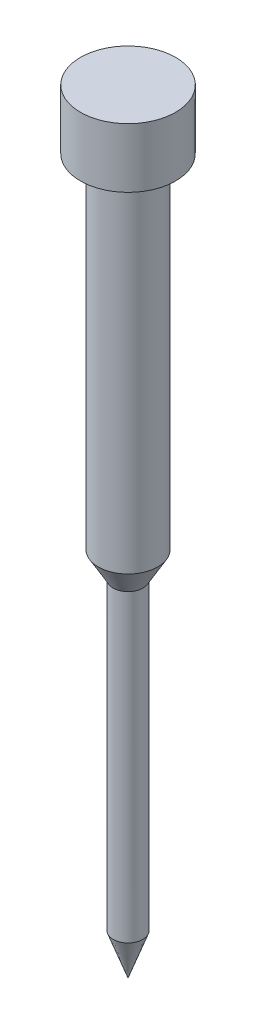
from build123d import *


with BuildPart() as part:
    # Sketch 1 → Revolve 1 (revolve)
    with BuildSketch(Plane.XY, mode=Mode.PRIVATE) as revolve_1_sk:
        Polygon((0, 0), (-1.25, 3.434346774), (-1.25, 29), (-2.5, 31.165063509), (-2.5, 60), (-4, 60), (-4, 65), (0, 65), align=None)
    revolve(revolve_1_sk.sketch.rotate(Axis((0, 0, 0), (0, 1, 0)), 270), axis=Axis((0, 0, 0), (0, 1, 0)))


solid = part.part
